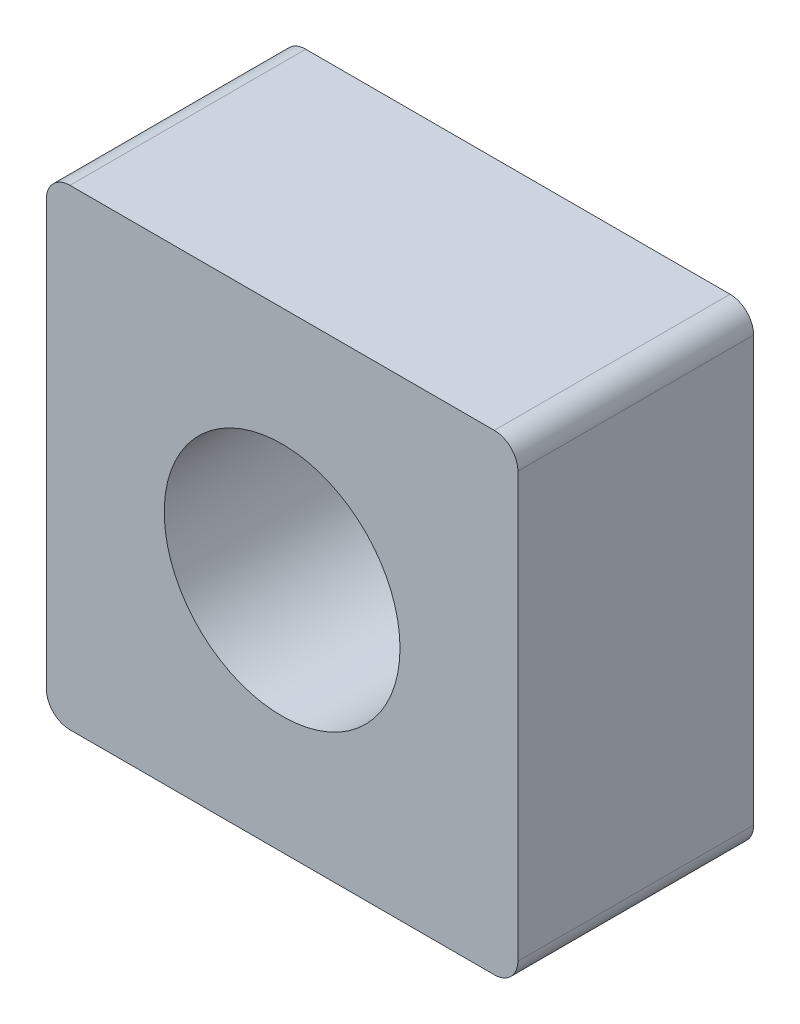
ISO-10303-21;
HEADER;
FILE_DESCRIPTION(('STEP AP214'),'2;1');
FILE_NAME('part.step','',(''),(''),'','','');
FILE_SCHEMA(('AUTOMOTIVE_DESIGN { 1 0 10303 214 1 1 1 1 }'));
ENDSEC;
DATA;
#1=APPLICATION_CONTEXT('core data for automotive mechanical design processes');
#2=APPLICATION_PROTOCOL_DEFINITION('international standard','automotive_design',2000,#1);
#3=PRODUCT_CONTEXT('',#1,'mechanical');
#4=PRODUCT('Part','Part','',(#3));
#5=PRODUCT_RELATED_PRODUCT_CATEGORY('part','',(#4));
#6=PRODUCT_DEFINITION_FORMATION('','',#4);
#7=PRODUCT_DEFINITION_CONTEXT('part definition',#1,'design');
#8=PRODUCT_DEFINITION('design','',#6,#7);
#9=PRODUCT_DEFINITION_SHAPE('','',#8);
#10=(LENGTH_UNIT() NAMED_UNIT(*) SI_UNIT(.MILLI.,.METRE.));
#11=(NAMED_UNIT(*) PLANE_ANGLE_UNIT() SI_UNIT($,.RADIAN.));
#12=(NAMED_UNIT(*) SI_UNIT($,.STERADIAN.) SOLID_ANGLE_UNIT());
#13=UNCERTAINTY_MEASURE_WITH_UNIT(LENGTH_MEASURE(1.E-05),#10,'distance_accuracy_value','');
#14=(GEOMETRIC_REPRESENTATION_CONTEXT(3) GLOBAL_UNCERTAINTY_ASSIGNED_CONTEXT((#13)) GLOBAL_UNIT_ASSIGNED_CONTEXT((#10,
#11,#12)) REPRESENTATION_CONTEXT('',''));
#15=CARTESIAN_POINT('',(0.,0.,0.));
#16=DIRECTION('',(0.,0.,1.));
#17=DIRECTION('',(1.,0.,0.));
#18=AXIS2_PLACEMENT_3D('',#15,#16,#17);
#19=CARTESIAN_POINT('',(-5.,5.,2.5));
#20=DIRECTION('',(1.,0.,0.));
#21=DIRECTION('',(0.,1.,0.));
#22=AXIS2_PLACEMENT_3D('',#19,#20,#21);
#23=PLANE('',#22);
#24=DIRECTION('',(0.,-1.,0.));
#25=VECTOR('',#24,1.);
#26=CARTESIAN_POINT('',(-5.,5.,2.5));
#27=LINE('',#26,#25);
#28=CARTESIAN_POINT('',(-5.,4.5,2.5));
#29=VERTEX_POINT('',#28);
#30=CARTESIAN_POINT('',(-5.,-4.5,2.5));
#31=VERTEX_POINT('',#30);
#32=EDGE_CURVE('E124',#29,#31,#27,.T.);
#33=ORIENTED_EDGE('',*,*,#32,.F.);
#34=DIRECTION('',(0.,0.,-1.));
#35=VECTOR('',#34,1.);
#36=CARTESIAN_POINT('',(-5.,4.5,2.5));
#37=LINE('',#36,#35);
#38=CARTESIAN_POINT('',(-5.,4.5,-2.5));
#39=VERTEX_POINT('',#38);
#40=EDGE_CURVE('E109',#29,#39,#37,.T.);
#41=ORIENTED_EDGE('',*,*,#40,.T.);
#42=DIRECTION('',(0.,-1.,0.));
#43=VECTOR('',#42,1.);
#44=CARTESIAN_POINT('',(-5.,5.,-2.5));
#45=LINE('',#44,#43);
#46=CARTESIAN_POINT('',(-5.,-4.5,-2.5));
#47=VERTEX_POINT('',#46);
#48=EDGE_CURVE('E121',#39,#47,#45,.T.);
#49=ORIENTED_EDGE('',*,*,#48,.T.);
#50=DIRECTION('',(0.,0.,-1.));
#51=VECTOR('',#50,1.);
#52=CARTESIAN_POINT('',(-5.,-4.5,2.5));
#53=LINE('',#52,#51);
#54=EDGE_CURVE('E126',#47,#31,#53,.F.);
#55=ORIENTED_EDGE('',*,*,#54,.T.);
#56=EDGE_LOOP('',(#33,#41,#49,#55));
#57=FACE_BOUND('',#56,.T.);
#58=ADVANCED_FACE('F39',(#57),#23,.F.);
#59=CARTESIAN_POINT('',(-5.,-5.,2.5));
#60=DIRECTION('',(0.,1.,0.));
#61=DIRECTION('',(0.,0.,1.));
#62=AXIS2_PLACEMENT_3D('',#59,#60,#61);
#63=PLANE('',#62);
#64=DIRECTION('',(1.,0.,0.));
#65=VECTOR('',#64,1.);
#66=CARTESIAN_POINT('',(-5.,-5.,2.5));
#67=LINE('',#66,#65);
#68=CARTESIAN_POINT('',(-4.5,-5.,2.5));
#69=VERTEX_POINT('',#68);
#70=CARTESIAN_POINT('',(4.5,-5.,2.5));
#71=VERTEX_POINT('',#70);
#72=EDGE_CURVE('E170',#69,#71,#67,.T.);
#73=ORIENTED_EDGE('',*,*,#72,.F.);
#74=DIRECTION('',(0.,0.,-1.));
#75=VECTOR('',#74,1.);
#76=CARTESIAN_POINT('',(-4.5,-5.,2.5));
#77=LINE('',#76,#75);
#78=CARTESIAN_POINT('',(-4.5,-5.,-2.5));
#79=VERTEX_POINT('',#78);
#80=EDGE_CURVE('E163',#69,#79,#77,.T.);
#81=ORIENTED_EDGE('',*,*,#80,.T.);
#82=DIRECTION('',(1.,0.,0.));
#83=VECTOR('',#82,1.);
#84=CARTESIAN_POINT('',(-5.,-5.,-2.5));
#85=LINE('',#84,#83);
#86=CARTESIAN_POINT('',(4.5,-5.,-2.5));
#87=VERTEX_POINT('',#86);
#88=EDGE_CURVE('E130',#79,#87,#85,.T.);
#89=ORIENTED_EDGE('',*,*,#88,.T.);
#90=DIRECTION('',(0.,0.,-1.));
#91=VECTOR('',#90,1.);
#92=CARTESIAN_POINT('',(4.5,-5.,2.5));
#93=LINE('',#92,#91);
#94=EDGE_CURVE('E161',#87,#71,#93,.F.);
#95=ORIENTED_EDGE('',*,*,#94,.T.);
#96=EDGE_LOOP('',(#73,#81,#89,#95));
#97=FACE_BOUND('',#96,.T.);
#98=ADVANCED_FACE('F168',(#97),#63,.F.);
#99=CARTESIAN_POINT('',(5.,5.,2.5));
#100=DIRECTION('',(-1.,0.,0.));
#101=DIRECTION('',(0.,-1.,0.));
#102=AXIS2_PLACEMENT_3D('',#99,#100,#101);
#103=PLANE('',#102);
#104=DIRECTION('',(0.,1.,0.));
#105=VECTOR('',#104,1.);
#106=CARTESIAN_POINT('',(5.,5.,2.5));
#107=LINE('',#106,#105);
#108=CARTESIAN_POINT('',(5.,-4.5,2.5));
#109=VERTEX_POINT('',#108);
#110=CARTESIAN_POINT('',(5.,4.5,2.5));
#111=VERTEX_POINT('',#110);
#112=EDGE_CURVE('E178',#109,#111,#107,.T.);
#113=ORIENTED_EDGE('',*,*,#112,.F.);
#114=DIRECTION('',(0.,0.,-1.));
#115=VECTOR('',#114,1.);
#116=CARTESIAN_POINT('',(5.,-4.5,2.5));
#117=LINE('',#116,#115);
#118=CARTESIAN_POINT('',(5.,-4.5,-2.5));
#119=VERTEX_POINT('',#118);
#120=EDGE_CURVE('E11',#109,#119,#117,.T.);
#121=ORIENTED_EDGE('',*,*,#120,.T.);
#122=DIRECTION('',(0.,1.,0.));
#123=VECTOR('',#122,1.);
#124=CARTESIAN_POINT('',(5.,5.,-2.5));
#125=LINE('',#124,#123);
#126=CARTESIAN_POINT('',(5.,4.5,-2.5));
#127=VERTEX_POINT('',#126);
#128=EDGE_CURVE('E134',#119,#127,#125,.T.);
#129=ORIENTED_EDGE('',*,*,#128,.T.);
#130=DIRECTION('',(0.,0.,-1.));
#131=VECTOR('',#130,1.);
#132=CARTESIAN_POINT('',(5.,4.5,2.5));
#133=LINE('',#132,#131);
#134=EDGE_CURVE('E47',#127,#111,#133,.F.);
#135=ORIENTED_EDGE('',*,*,#134,.T.);
#136=EDGE_LOOP('',(#113,#121,#129,#135));
#137=FACE_BOUND('',#136,.T.);
#138=ADVANCED_FACE('F177',(#137),#103,.F.);
#139=CARTESIAN_POINT('',(-5.,5.,2.5));
#140=DIRECTION('',(0.,-1.,0.));
#141=DIRECTION('',(1.,0.,0.));
#142=AXIS2_PLACEMENT_3D('',#139,#140,#141);
#143=PLANE('',#142);
#144=DIRECTION('',(-1.,0.,0.));
#145=VECTOR('',#144,1.);
#146=CARTESIAN_POINT('',(-5.,5.,-2.5));
#147=LINE('',#146,#145);
#148=CARTESIAN_POINT('',(4.5,5.,-2.5));
#149=VERTEX_POINT('',#148);
#150=CARTESIAN_POINT('',(-4.5,5.,-2.5));
#151=VERTEX_POINT('',#150);
#152=EDGE_CURVE('E144',#149,#151,#147,.T.);
#153=ORIENTED_EDGE('',*,*,#152,.T.);
#154=DIRECTION('',(0.,0.,-1.));
#155=VECTOR('',#154,1.);
#156=CARTESIAN_POINT('',(-4.5,5.,2.5));
#157=LINE('',#156,#155);
#158=CARTESIAN_POINT('',(-4.5,5.,2.5));
#159=VERTEX_POINT('',#158);
#160=EDGE_CURVE('E110',#151,#159,#157,.F.);
#161=ORIENTED_EDGE('',*,*,#160,.T.);
#162=DIRECTION('',(-1.,0.,0.));
#163=VECTOR('',#162,1.);
#164=CARTESIAN_POINT('',(-5.,5.,2.5));
#165=LINE('',#164,#163);
#166=CARTESIAN_POINT('',(4.5,5.,2.5));
#167=VERTEX_POINT('',#166);
#168=EDGE_CURVE('E140',#167,#159,#165,.T.);
#169=ORIENTED_EDGE('',*,*,#168,.F.);
#170=DIRECTION('',(0.,0.,-1.));
#171=VECTOR('',#170,1.);
#172=CARTESIAN_POINT('',(4.5,5.,2.5));
#173=LINE('',#172,#171);
#174=EDGE_CURVE('E115',#167,#149,#173,.T.);
#175=ORIENTED_EDGE('',*,*,#174,.T.);
#176=EDGE_LOOP('',(#153,#161,#169,#175));
#177=FACE_BOUND('',#176,.T.);
#178=ADVANCED_FACE('F191',(#177),#143,.F.);
#179=CARTESIAN_POINT('',(-5.,5.,2.5));
#180=DIRECTION('',(0.,0.,1.));
#181=DIRECTION('',(1.,0.,0.));
#182=AXIS2_PLACEMENT_3D('',#179,#180,#181);
#183=PLANE('',#182);
#184=CARTESIAN_POINT('',(0.,0.,2.5));
#185=DIRECTION('',(0.,0.,1.));
#186=DIRECTION('',(1.,0.,0.));
#187=AXIS2_PLACEMENT_3D('',#184,#185,#186);
#188=CIRCLE('',#187,2.5);
#189=CARTESIAN_POINT('',(2.5,0.,2.5));
#190=VERTEX_POINT('',#189);
#191=EDGE_CURVE('E137',#190,#190,#188,.T.);
#192=ORIENTED_EDGE('',*,*,#191,.F.);
#193=EDGE_LOOP('',(#192));
#194=FACE_BOUND('',#193,.T.);
#195=ORIENTED_EDGE('',*,*,#168,.T.);
#196=CARTESIAN_POINT('',(-4.5,4.5,2.5));
#197=DIRECTION('',(0.,0.,1.));
#198=DIRECTION('',(1.,0.,0.));
#199=AXIS2_PLACEMENT_3D('',#196,#197,#198);
#200=CIRCLE('',#199,0.5);
#201=EDGE_CURVE('E159',#159,#29,#200,.T.);
#202=ORIENTED_EDGE('',*,*,#201,.T.);
#203=ORIENTED_EDGE('',*,*,#32,.T.);
#204=CARTESIAN_POINT('',(-4.5,-4.5,2.5));
#205=DIRECTION('',(0.,0.,1.));
#206=DIRECTION('',(1.,0.,0.));
#207=AXIS2_PLACEMENT_3D('',#204,#205,#206);
#208=CIRCLE('',#207,0.5);
#209=EDGE_CURVE('E157',#31,#69,#208,.T.);
#210=ORIENTED_EDGE('',*,*,#209,.T.);
#211=ORIENTED_EDGE('',*,*,#72,.T.);
#212=CARTESIAN_POINT('',(4.5,-4.5,2.5));
#213=DIRECTION('',(0.,0.,1.));
#214=DIRECTION('',(1.,0.,0.));
#215=AXIS2_PLACEMENT_3D('',#212,#213,#214);
#216=CIRCLE('',#215,0.5);
#217=EDGE_CURVE('E60',#71,#109,#216,.T.);
#218=ORIENTED_EDGE('',*,*,#217,.T.);
#219=ORIENTED_EDGE('',*,*,#112,.T.);
#220=CARTESIAN_POINT('',(4.5,4.5,2.5));
#221=DIRECTION('',(0.,0.,1.));
#222=DIRECTION('',(1.,0.,0.));
#223=AXIS2_PLACEMENT_3D('',#220,#221,#222);
#224=CIRCLE('',#223,0.5);
#225=EDGE_CURVE('E154',#111,#167,#224,.T.);
#226=ORIENTED_EDGE('',*,*,#225,.T.);
#227=EDGE_LOOP('',(#195,#202,#203,#210,#211,#218,#219,#226));
#228=FACE_BOUND('',#227,.T.);
#229=ADVANCED_FACE('F189',(#194,#228),#183,.T.);
#230=CARTESIAN_POINT('',(-5.,5.,-2.5));
#231=DIRECTION('',(0.,0.,1.));
#232=DIRECTION('',(1.,0.,0.));
#233=AXIS2_PLACEMENT_3D('',#230,#231,#232);
#234=PLANE('',#233);
#235=CARTESIAN_POINT('',(0.,0.,-2.5));
#236=DIRECTION('',(0.,0.,1.));
#237=DIRECTION('',(1.,0.,0.));
#238=AXIS2_PLACEMENT_3D('',#235,#236,#237);
#239=CIRCLE('',#238,2.5);
#240=CARTESIAN_POINT('',(2.5,0.,-2.5));
#241=VERTEX_POINT('',#240);
#242=EDGE_CURVE('E131',#241,#241,#239,.T.);
#243=ORIENTED_EDGE('',*,*,#242,.T.);
#244=EDGE_LOOP('',(#243));
#245=FACE_BOUND('',#244,.T.);
#246=ORIENTED_EDGE('',*,*,#48,.F.);
#247=CARTESIAN_POINT('',(-4.5,4.5,-2.5));
#248=DIRECTION('',(0.,0.,1.));
#249=DIRECTION('',(1.,0.,0.));
#250=AXIS2_PLACEMENT_3D('',#247,#248,#249);
#251=CIRCLE('',#250,0.5);
#252=EDGE_CURVE('E105',#39,#151,#251,.F.);
#253=ORIENTED_EDGE('',*,*,#252,.T.);
#254=ORIENTED_EDGE('',*,*,#152,.F.);
#255=CARTESIAN_POINT('',(4.5,4.5,-2.5));
#256=DIRECTION('',(0.,0.,1.));
#257=DIRECTION('',(1.,0.,0.));
#258=AXIS2_PLACEMENT_3D('',#255,#256,#257);
#259=CIRCLE('',#258,0.5);
#260=EDGE_CURVE('E125',#149,#127,#259,.F.);
#261=ORIENTED_EDGE('',*,*,#260,.T.);
#262=ORIENTED_EDGE('',*,*,#128,.F.);
#263=CARTESIAN_POINT('',(4.5,-4.5,-2.5));
#264=DIRECTION('',(0.,0.,1.));
#265=DIRECTION('',(1.,0.,0.));
#266=AXIS2_PLACEMENT_3D('',#263,#264,#265);
#267=CIRCLE('',#266,0.5);
#268=EDGE_CURVE('E148',#119,#87,#267,.F.);
#269=ORIENTED_EDGE('',*,*,#268,.T.);
#270=ORIENTED_EDGE('',*,*,#88,.F.);
#271=CARTESIAN_POINT('',(-4.5,-4.5,-2.5));
#272=DIRECTION('',(0.,0.,1.));
#273=DIRECTION('',(1.,0.,0.));
#274=AXIS2_PLACEMENT_3D('',#271,#272,#273);
#275=CIRCLE('',#274,0.5);
#276=EDGE_CURVE('E116',#79,#47,#275,.F.);
#277=ORIENTED_EDGE('',*,*,#276,.T.);
#278=EDGE_LOOP('',(#246,#253,#254,#261,#262,#269,#270,#277));
#279=FACE_BOUND('',#278,.T.);
#280=ADVANCED_FACE('F128',(#245,#279),#234,.F.);
#281=CARTESIAN_POINT('',(0.,0.,2.5));
#282=DIRECTION('',(0.,0.,1.));
#283=DIRECTION('',(1.,0.,0.));
#284=AXIS2_PLACEMENT_3D('',#281,#282,#283);
#285=CYLINDRICAL_SURFACE('',#284,2.5);
#286=ORIENTED_EDGE('',*,*,#242,.F.);
#287=EDGE_LOOP('',(#286));
#288=FACE_BOUND('',#287,.T.);
#289=ORIENTED_EDGE('',*,*,#191,.T.);
#290=EDGE_LOOP('',(#289));
#291=FACE_BOUND('',#290,.T.);
#292=ADVANCED_FACE('F187',(#288,#291),#285,.F.);
#293=CARTESIAN_POINT('',(-4.5,4.5,2.5));
#294=DIRECTION('',(0.,0.,-1.));
#295=DIRECTION('',(-1.,0.,0.));
#296=AXIS2_PLACEMENT_3D('',#293,#294,#295);
#297=CYLINDRICAL_SURFACE('',#296,0.5);
#298=ORIENTED_EDGE('',*,*,#201,.F.);
#299=ORIENTED_EDGE('',*,*,#160,.F.);
#300=ORIENTED_EDGE('',*,*,#252,.F.);
#301=ORIENTED_EDGE('',*,*,#40,.F.);
#302=EDGE_LOOP('',(#298,#299,#300,#301));
#303=FACE_BOUND('',#302,.T.);
#304=ADVANCED_FACE('F108',(#303),#297,.T.);
#305=CARTESIAN_POINT('',(-4.5,-4.5,2.5));
#306=DIRECTION('',(0.,0.,-1.));
#307=DIRECTION('',(-1.,0.,0.));
#308=AXIS2_PLACEMENT_3D('',#305,#306,#307);
#309=CYLINDRICAL_SURFACE('',#308,0.5);
#310=ORIENTED_EDGE('',*,*,#209,.F.);
#311=ORIENTED_EDGE('',*,*,#54,.F.);
#312=ORIENTED_EDGE('',*,*,#276,.F.);
#313=ORIENTED_EDGE('',*,*,#80,.F.);
#314=EDGE_LOOP('',(#310,#311,#312,#313));
#315=FACE_BOUND('',#314,.T.);
#316=ADVANCED_FACE('F201',(#315),#309,.T.);
#317=CARTESIAN_POINT('',(4.5,-4.5,2.5));
#318=DIRECTION('',(0.,0.,-1.));
#319=DIRECTION('',(-1.,0.,0.));
#320=AXIS2_PLACEMENT_3D('',#317,#318,#319);
#321=CYLINDRICAL_SURFACE('',#320,0.5);
#322=ORIENTED_EDGE('',*,*,#217,.F.);
#323=ORIENTED_EDGE('',*,*,#94,.F.);
#324=ORIENTED_EDGE('',*,*,#268,.F.);
#325=ORIENTED_EDGE('',*,*,#120,.F.);
#326=EDGE_LOOP('',(#322,#323,#324,#325));
#327=FACE_BOUND('',#326,.T.);
#328=ADVANCED_FACE('F176',(#327),#321,.T.);
#329=CARTESIAN_POINT('',(4.5,4.5,2.5));
#330=DIRECTION('',(0.,0.,-1.));
#331=DIRECTION('',(-1.,0.,0.));
#332=AXIS2_PLACEMENT_3D('',#329,#330,#331);
#333=CYLINDRICAL_SURFACE('',#332,0.5);
#334=ORIENTED_EDGE('',*,*,#225,.F.);
#335=ORIENTED_EDGE('',*,*,#134,.F.);
#336=ORIENTED_EDGE('',*,*,#260,.F.);
#337=ORIENTED_EDGE('',*,*,#174,.F.);
#338=EDGE_LOOP('',(#334,#335,#336,#337));
#339=FACE_BOUND('',#338,.T.);
#340=ADVANCED_FACE('F41',(#339),#333,.T.);
#341=CLOSED_SHELL('',(#58,#98,#138,#178,#229,#280,#292,#304,#316,#328,#340));
#342=MANIFOLD_SOLID_BREP('B2',#341);
#343=ADVANCED_BREP_SHAPE_REPRESENTATION('',(#18,#342),#14);
#344=SHAPE_DEFINITION_REPRESENTATION(#9,#343);
ENDSEC;
END-ISO-10303-21;
